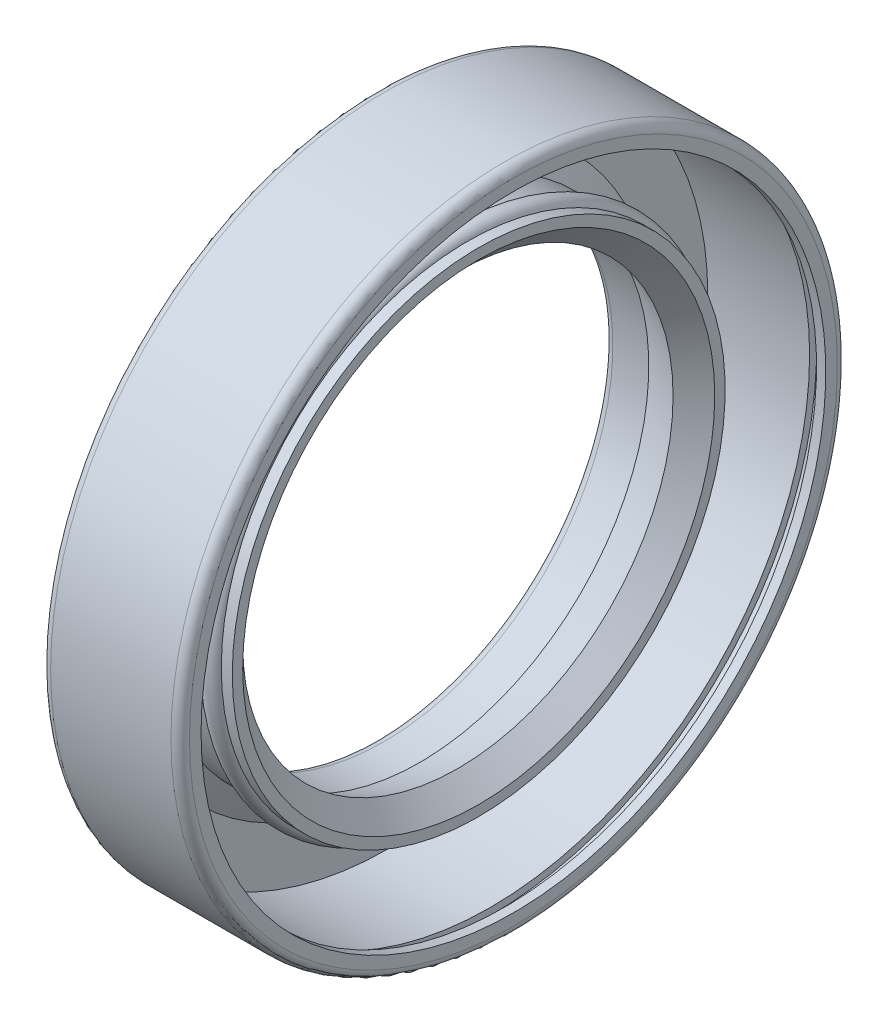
ISO-10303-21;
HEADER;
FILE_DESCRIPTION(('STEP AP214'),'2;1');
FILE_NAME('part.step','',(''),(''),'','','');
FILE_SCHEMA(('AUTOMOTIVE_DESIGN { 1 0 10303 214 1 1 1 1 }'));
ENDSEC;
DATA;
#1=APPLICATION_CONTEXT('core data for automotive mechanical design processes');
#2=APPLICATION_PROTOCOL_DEFINITION('international standard','automotive_design',2000,#1);
#3=PRODUCT_CONTEXT('',#1,'mechanical');
#4=PRODUCT('Part','Part','',(#3));
#5=PRODUCT_RELATED_PRODUCT_CATEGORY('part','',(#4));
#6=PRODUCT_DEFINITION_FORMATION('','',#4);
#7=PRODUCT_DEFINITION_CONTEXT('part definition',#1,'design');
#8=PRODUCT_DEFINITION('design','',#6,#7);
#9=PRODUCT_DEFINITION_SHAPE('','',#8);
#10=(LENGTH_UNIT() NAMED_UNIT(*) SI_UNIT(.MILLI.,.METRE.));
#11=(NAMED_UNIT(*) PLANE_ANGLE_UNIT() SI_UNIT($,.RADIAN.));
#12=(NAMED_UNIT(*) SI_UNIT($,.STERADIAN.) SOLID_ANGLE_UNIT());
#13=UNCERTAINTY_MEASURE_WITH_UNIT(LENGTH_MEASURE(1.E-05),#10,'distance_accuracy_value','');
#14=(GEOMETRIC_REPRESENTATION_CONTEXT(3) GLOBAL_UNCERTAINTY_ASSIGNED_CONTEXT((#13)) GLOBAL_UNIT_ASSIGNED_CONTEXT((#10,
#11,#12)) REPRESENTATION_CONTEXT('',''));
#15=CARTESIAN_POINT('',(0.,0.,0.));
#16=DIRECTION('',(0.,0.,1.));
#17=DIRECTION('',(1.,0.,0.));
#18=AXIS2_PLACEMENT_3D('',#15,#16,#17);
#19=CARTESIAN_POINT('',(0.,0.,0.));
#20=DIRECTION('',(-1.,0.,0.));
#21=DIRECTION('',(0.,0.,1.));
#22=AXIS2_PLACEMENT_3D('',#19,#20,#21);
#23=CONICAL_SURFACE('',#22,9.43301270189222,1.04719755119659);
#24=CARTESIAN_POINT('',(0.250000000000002,0.,0.));
#25=DIRECTION('',(-1.,0.,0.));
#26=DIRECTION('',(0.,0.,1.));
#27=AXIS2_PLACEMENT_3D('',#24,#25,#26);
#28=CIRCLE('',#27,9.);
#29=CARTESIAN_POINT('',(0.250000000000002,0.,9.));
#30=VERTEX_POINT('',#29);
#31=EDGE_CURVE('E10',#30,#30,#28,.T.);
#32=ORIENTED_EDGE('',*,*,#31,.F.);
#33=EDGE_LOOP('',(#32));
#34=FACE_BOUND('',#33,.T.);
#35=CARTESIAN_POINT('',(0.,0.,0.));
#36=DIRECTION('',(-1.,0.,0.));
#37=DIRECTION('',(0.,0.,1.));
#38=AXIS2_PLACEMENT_3D('',#35,#36,#37);
#39=CIRCLE('',#38,9.43301270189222);
#40=CARTESIAN_POINT('',(0.,0.,9.43301270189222));
#41=VERTEX_POINT('',#40);
#42=EDGE_CURVE('E97',#41,#41,#39,.T.);
#43=ORIENTED_EDGE('',*,*,#42,.T.);
#44=EDGE_LOOP('',(#43));
#45=FACE_BOUND('',#44,.T.);
#46=ADVANCED_FACE('F24',(#34,#45),#23,.F.);
#47=CARTESIAN_POINT('',(0.,0.,0.));
#48=DIRECTION('',(-1.,0.,0.));
#49=DIRECTION('',(0.,0.,1.));
#50=AXIS2_PLACEMENT_3D('',#47,#48,#49);
#51=CYLINDRICAL_SURFACE('',#50,9.);
#52=CARTESIAN_POINT('',(0.,0.,0.));
#53=DIRECTION('',(-1.,0.,0.));
#54=DIRECTION('',(0.,0.,1.));
#55=AXIS2_PLACEMENT_3D('',#52,#53,#54);
#56=CIRCLE('',#55,9.);
#57=CARTESIAN_POINT('',(0.,0.,9.));
#58=VERTEX_POINT('',#57);
#59=EDGE_CURVE('E30',#58,#58,#56,.T.);
#60=ORIENTED_EDGE('',*,*,#59,.F.);
#61=EDGE_LOOP('',(#60));
#62=FACE_BOUND('',#61,.T.);
#63=ORIENTED_EDGE('',*,*,#31,.T.);
#64=EDGE_LOOP('',(#63));
#65=FACE_BOUND('',#64,.T.);
#66=ADVANCED_FACE('F224',(#62,#65),#51,.T.);
#67=CARTESIAN_POINT('',(0.,0.,-9.));
#68=DIRECTION('',(1.,0.,0.));
#69=DIRECTION('',(0.,0.,-1.));
#70=AXIS2_PLACEMENT_3D('',#67,#68,#69);
#71=PLANE('',#70);
#72=CARTESIAN_POINT('',(0.,0.,0.));
#73=DIRECTION('',(-1.,0.,0.));
#74=DIRECTION('',(0.,0.,1.));
#75=AXIS2_PLACEMENT_3D('',#72,#73,#74);
#76=CIRCLE('',#75,8.58333333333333);
#77=CARTESIAN_POINT('',(0.,0.,8.58333333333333));
#78=VERTEX_POINT('',#77);
#79=EDGE_CURVE('E34',#78,#78,#76,.T.);
#80=ORIENTED_EDGE('',*,*,#79,.F.);
#81=EDGE_LOOP('',(#80));
#82=FACE_BOUND('',#81,.T.);
#83=ORIENTED_EDGE('',*,*,#59,.T.);
#84=EDGE_LOOP('',(#83));
#85=FACE_BOUND('',#84,.T.);
#86=ADVANCED_FACE('F219',(#82,#85),#71,.F.);
#87=CARTESIAN_POINT('',(0.333333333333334,0.,0.));
#88=DIRECTION('',(-1.,0.,0.));
#89=DIRECTION('',(0.,0.,1.));
#90=AXIS2_PLACEMENT_3D('',#87,#88,#89);
#91=TOROIDAL_SURFACE('',#90,8.58333333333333,0.333333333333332);
#92=CARTESIAN_POINT('',(0.333333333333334,0.,0.));
#93=DIRECTION('',(-1.,0.,0.));
#94=DIRECTION('',(0.,0.,1.));
#95=AXIS2_PLACEMENT_3D('',#92,#93,#94);
#96=CIRCLE('',#95,8.25);
#97=CARTESIAN_POINT('',(0.333333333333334,0.,8.25));
#98=VERTEX_POINT('',#97);
#99=EDGE_CURVE('E38',#98,#98,#96,.T.);
#100=ORIENTED_EDGE('',*,*,#99,.F.);
#101=EDGE_LOOP('',(#100));
#102=FACE_BOUND('',#101,.T.);
#103=ORIENTED_EDGE('',*,*,#79,.T.);
#104=EDGE_LOOP('',(#103));
#105=FACE_BOUND('',#104,.T.);
#106=ADVANCED_FACE('F213',(#102,#105),#91,.T.);
#107=CARTESIAN_POINT('',(0.,0.,0.));
#108=DIRECTION('',(-1.,0.,0.));
#109=DIRECTION('',(0.,0.,1.));
#110=AXIS2_PLACEMENT_3D('',#107,#108,#109);
#111=CYLINDRICAL_SURFACE('',#110,8.25);
#112=CARTESIAN_POINT('',(1.62626129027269,0.,0.));
#113=DIRECTION('',(-1.,0.,0.));
#114=DIRECTION('',(0.,0.,1.));
#115=AXIS2_PLACEMENT_3D('',#112,#113,#114);
#116=CIRCLE('',#115,8.25);
#117=CARTESIAN_POINT('',(1.62626129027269,0.,8.25));
#118=VERTEX_POINT('',#117);
#119=EDGE_CURVE('E43',#118,#118,#116,.T.);
#120=ORIENTED_EDGE('',*,*,#119,.F.);
#121=EDGE_LOOP('',(#120));
#122=FACE_BOUND('',#121,.T.);
#123=ORIENTED_EDGE('',*,*,#99,.T.);
#124=EDGE_LOOP('',(#123));
#125=FACE_BOUND('',#124,.T.);
#126=ADVANCED_FACE('F207',(#122,#125),#111,.F.);
#127=CARTESIAN_POINT('',(1.62626129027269,0.,0.));
#128=DIRECTION('',(-1.,0.,0.));
#129=DIRECTION('',(0.,0.,1.));
#130=AXIS2_PLACEMENT_3D('',#127,#128,#129);
#131=CONICAL_SURFACE('',#130,8.25,0.349065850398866);
#132=CARTESIAN_POINT('',(3.,0.,0.));
#133=DIRECTION('',(-1.,0.,0.));
#134=DIRECTION('',(0.,0.,1.));
#135=AXIS2_PLACEMENT_3D('',#132,#133,#134);
#136=CIRCLE('',#135,7.75);
#137=CARTESIAN_POINT('',(3.,0.,7.75));
#138=VERTEX_POINT('',#137);
#139=EDGE_CURVE('E46',#138,#138,#136,.T.);
#140=ORIENTED_EDGE('',*,*,#139,.F.);
#141=EDGE_LOOP('',(#140));
#142=FACE_BOUND('',#141,.T.);
#143=ORIENTED_EDGE('',*,*,#119,.T.);
#144=EDGE_LOOP('',(#143));
#145=FACE_BOUND('',#144,.T.);
#146=ADVANCED_FACE('F201',(#142,#145),#131,.F.);
#147=CARTESIAN_POINT('',(3.,0.,0.));
#148=DIRECTION('',(1.,0.,0.));
#149=DIRECTION('',(0.,0.,-1.));
#150=AXIS2_PLACEMENT_3D('',#147,#148,#149);
#151=CONICAL_SURFACE('',#150,7.75,0.78539816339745);
#152=CARTESIAN_POINT('',(3.75,0.,0.));
#153=DIRECTION('',(-1.,0.,0.));
#154=DIRECTION('',(0.,0.,1.));
#155=AXIS2_PLACEMENT_3D('',#152,#153,#154);
#156=CIRCLE('',#155,8.5);
#157=CARTESIAN_POINT('',(3.75,0.,8.5));
#158=VERTEX_POINT('',#157);
#159=EDGE_CURVE('E49',#158,#158,#156,.T.);
#160=ORIENTED_EDGE('',*,*,#159,.F.);
#161=EDGE_LOOP('',(#160));
#162=FACE_BOUND('',#161,.T.);
#163=ORIENTED_EDGE('',*,*,#139,.T.);
#164=EDGE_LOOP('',(#163));
#165=FACE_BOUND('',#164,.T.);
#166=ADVANCED_FACE('F195',(#162,#165),#151,.F.);
#167=CARTESIAN_POINT('',(3.75,0.,-8.5));
#168=DIRECTION('',(-1.,0.,0.));
#169=DIRECTION('',(0.,0.,1.));
#170=AXIS2_PLACEMENT_3D('',#167,#168,#169);
#171=PLANE('',#170);
#172=CARTESIAN_POINT('',(3.75,0.,0.));
#173=DIRECTION('',(-1.,0.,0.));
#174=DIRECTION('',(0.,0.,1.));
#175=AXIS2_PLACEMENT_3D('',#172,#173,#174);
#176=CIRCLE('',#175,8.875);
#177=CARTESIAN_POINT('',(3.75,0.,8.875));
#178=VERTEX_POINT('',#177);
#179=EDGE_CURVE('E52',#178,#178,#176,.T.);
#180=ORIENTED_EDGE('',*,*,#179,.F.);
#181=EDGE_LOOP('',(#180));
#182=FACE_BOUND('',#181,.T.);
#183=ORIENTED_EDGE('',*,*,#159,.T.);
#184=EDGE_LOOP('',(#183));
#185=FACE_BOUND('',#184,.T.);
#186=ADVANCED_FACE('F189',(#182,#185),#171,.F.);
#187=CARTESIAN_POINT('',(0.,0.,0.));
#188=DIRECTION('',(-1.,0.,0.));
#189=DIRECTION('',(0.,0.,1.));
#190=AXIS2_PLACEMENT_3D('',#187,#188,#189);
#191=CYLINDRICAL_SURFACE('',#190,8.875);
#192=CARTESIAN_POINT('',(3.35355339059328,0.,0.));
#193=DIRECTION('',(-1.,0.,0.));
#194=DIRECTION('',(0.,0.,1.));
#195=AXIS2_PLACEMENT_3D('',#192,#193,#194);
#196=CIRCLE('',#195,8.875);
#197=CARTESIAN_POINT('',(3.35355339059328,0.,8.875));
#198=VERTEX_POINT('',#197);
#199=EDGE_CURVE('E55',#198,#198,#196,.T.);
#200=ORIENTED_EDGE('',*,*,#199,.F.);
#201=EDGE_LOOP('',(#200));
#202=FACE_BOUND('',#201,.T.);
#203=ORIENTED_EDGE('',*,*,#179,.T.);
#204=EDGE_LOOP('',(#203));
#205=FACE_BOUND('',#204,.T.);
#206=ADVANCED_FACE('F183',(#202,#205),#191,.T.);
#207=CARTESIAN_POINT('',(3.,0.,0.));
#208=DIRECTION('',(-1.,0.,0.));
#209=DIRECTION('',(0.,0.,1.));
#210=AXIS2_PLACEMENT_3D('',#207,#208,#209);
#211=TOROIDAL_SURFACE('',#210,8.75,0.375);
#212=CARTESIAN_POINT('',(2.625,0.,0.));
#213=DIRECTION('',(-1.,0.,0.));
#214=DIRECTION('',(0.,0.,1.));
#215=AXIS2_PLACEMENT_3D('',#212,#213,#214);
#216=CIRCLE('',#215,8.75);
#217=CARTESIAN_POINT('',(2.625,0.,8.75));
#218=VERTEX_POINT('',#217);
#219=EDGE_CURVE('E58',#218,#218,#216,.T.);
#220=ORIENTED_EDGE('',*,*,#219,.F.);
#221=EDGE_LOOP('',(#220));
#222=FACE_BOUND('',#221,.T.);
#223=ORIENTED_EDGE('',*,*,#199,.T.);
#224=EDGE_LOOP('',(#223));
#225=FACE_BOUND('',#224,.T.);
#226=ADVANCED_FACE('F177',(#222,#225),#211,.T.);
#227=CARTESIAN_POINT('',(0.,0.,0.));
#228=DIRECTION('',(-1.,0.,0.));
#229=DIRECTION('',(0.,0.,1.));
#230=AXIS2_PLACEMENT_3D('',#227,#228,#229);
#231=CYLINDRICAL_SURFACE('',#230,8.75);
#232=CARTESIAN_POINT('',(0.971687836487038,0.,0.));
#233=DIRECTION('',(-1.,0.,0.));
#234=DIRECTION('',(0.,0.,1.));
#235=AXIS2_PLACEMENT_3D('',#232,#233,#234);
#236=CIRCLE('',#235,8.75);
#237=CARTESIAN_POINT('',(0.971687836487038,0.,8.75));
#238=VERTEX_POINT('',#237);
#239=EDGE_CURVE('E61',#238,#238,#236,.T.);
#240=ORIENTED_EDGE('',*,*,#239,.F.);
#241=EDGE_LOOP('',(#240));
#242=FACE_BOUND('',#241,.T.);
#243=ORIENTED_EDGE('',*,*,#219,.T.);
#244=EDGE_LOOP('',(#243));
#245=FACE_BOUND('',#244,.T.);
#246=ADVANCED_FACE('F171',(#242,#245),#231,.T.);
#247=CARTESIAN_POINT('',(0.971687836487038,0.,0.));
#248=DIRECTION('',(-1.,0.,0.));
#249=DIRECTION('',(0.,0.,1.));
#250=AXIS2_PLACEMENT_3D('',#247,#248,#249);
#251=CONICAL_SURFACE('',#250,8.75,1.04719755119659);
#252=CARTESIAN_POINT('',(0.500000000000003,0.,0.));
#253=DIRECTION('',(-1.,0.,0.));
#254=DIRECTION('',(0.,0.,1.));
#255=AXIS2_PLACEMENT_3D('',#252,#253,#254);
#256=CIRCLE('',#255,9.56698729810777);
#257=CARTESIAN_POINT('',(0.500000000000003,0.,9.56698729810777));
#258=VERTEX_POINT('',#257);
#259=EDGE_CURVE('E64',#258,#258,#256,.T.);
#260=ORIENTED_EDGE('',*,*,#259,.F.);
#261=EDGE_LOOP('',(#260));
#262=FACE_BOUND('',#261,.T.);
#263=ORIENTED_EDGE('',*,*,#239,.T.);
#264=EDGE_LOOP('',(#263));
#265=FACE_BOUND('',#264,.T.);
#266=ADVANCED_FACE('F165',(#262,#265),#251,.T.);
#267=CARTESIAN_POINT('',(0.500000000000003,0.,-11.5));
#268=DIRECTION('',(-1.,0.,0.));
#269=DIRECTION('',(0.,0.,1.));
#270=AXIS2_PLACEMENT_3D('',#267,#268,#269);
#271=PLANE('',#270);
#272=CARTESIAN_POINT('',(0.500000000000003,0.,0.));
#273=DIRECTION('',(-1.,0.,0.));
#274=DIRECTION('',(0.,0.,1.));
#275=AXIS2_PLACEMENT_3D('',#272,#273,#274);
#276=CIRCLE('',#275,11.5);
#277=CARTESIAN_POINT('',(0.500000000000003,0.,11.5));
#278=VERTEX_POINT('',#277);
#279=EDGE_CURVE('E67',#278,#278,#276,.T.);
#280=ORIENTED_EDGE('',*,*,#279,.F.);
#281=EDGE_LOOP('',(#280));
#282=FACE_BOUND('',#281,.T.);
#283=ORIENTED_EDGE('',*,*,#259,.T.);
#284=EDGE_LOOP('',(#283));
#285=FACE_BOUND('',#284,.T.);
#286=ADVANCED_FACE('F159',(#282,#285),#271,.F.);
#287=CARTESIAN_POINT('',(0.,0.,0.));
#288=DIRECTION('',(-1.,0.,0.));
#289=DIRECTION('',(0.,0.,1.));
#290=AXIS2_PLACEMENT_3D('',#287,#288,#289);
#291=CYLINDRICAL_SURFACE('',#290,11.5);
#292=CARTESIAN_POINT('',(4.16666666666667,0.,0.));
#293=DIRECTION('',(-1.,0.,0.));
#294=DIRECTION('',(0.,0.,1.));
#295=AXIS2_PLACEMENT_3D('',#292,#293,#294);
#296=CIRCLE('',#295,11.5);
#297=CARTESIAN_POINT('',(4.16666666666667,0.,11.5));
#298=VERTEX_POINT('',#297);
#299=EDGE_CURVE('E70',#298,#298,#296,.T.);
#300=ORIENTED_EDGE('',*,*,#299,.F.);
#301=EDGE_LOOP('',(#300));
#302=FACE_BOUND('',#301,.T.);
#303=ORIENTED_EDGE('',*,*,#279,.T.);
#304=EDGE_LOOP('',(#303));
#305=FACE_BOUND('',#304,.T.);
#306=ADVANCED_FACE('F153',(#302,#305),#291,.F.);
#307=CARTESIAN_POINT('',(4.16666666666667,0.,-11.5));
#308=DIRECTION('',(-1.,0.,0.));
#309=DIRECTION('',(0.,0.,1.));
#310=AXIS2_PLACEMENT_3D('',#307,#308,#309);
#311=PLANE('',#310);
#312=CARTESIAN_POINT('',(4.16666666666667,0.,0.));
#313=DIRECTION('',(-1.,0.,0.));
#314=DIRECTION('',(0.,0.,1.));
#315=AXIS2_PLACEMENT_3D('',#312,#313,#314);
#316=CIRCLE('',#315,11.75);
#317=CARTESIAN_POINT('',(4.16666666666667,0.,11.75));
#318=VERTEX_POINT('',#317);
#319=EDGE_CURVE('E73',#318,#318,#316,.T.);
#320=ORIENTED_EDGE('',*,*,#319,.F.);
#321=EDGE_LOOP('',(#320));
#322=FACE_BOUND('',#321,.T.);
#323=ORIENTED_EDGE('',*,*,#299,.T.);
#324=EDGE_LOOP('',(#323));
#325=FACE_BOUND('',#324,.T.);
#326=ADVANCED_FACE('F147',(#322,#325),#311,.F.);
#327=CARTESIAN_POINT('',(0.,0.,0.));
#328=DIRECTION('',(-1.,0.,0.));
#329=DIRECTION('',(0.,0.,1.));
#330=AXIS2_PLACEMENT_3D('',#327,#328,#329);
#331=CYLINDRICAL_SURFACE('',#330,11.75);
#332=CARTESIAN_POINT('',(4.66666666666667,0.,0.));
#333=DIRECTION('',(-1.,0.,0.));
#334=DIRECTION('',(0.,0.,1.));
#335=AXIS2_PLACEMENT_3D('',#332,#333,#334);
#336=CIRCLE('',#335,11.75);
#337=CARTESIAN_POINT('',(4.66666666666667,0.,11.75));
#338=VERTEX_POINT('',#337);
#339=EDGE_CURVE('E76',#338,#338,#336,.T.);
#340=ORIENTED_EDGE('',*,*,#339,.F.);
#341=EDGE_LOOP('',(#340));
#342=FACE_BOUND('',#341,.T.);
#343=ORIENTED_EDGE('',*,*,#319,.T.);
#344=EDGE_LOOP('',(#343));
#345=FACE_BOUND('',#344,.T.);
#346=ADVANCED_FACE('F141',(#342,#345),#331,.F.);
#347=CARTESIAN_POINT('',(4.66666666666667,0.,-11.75));
#348=DIRECTION('',(1.,0.,0.));
#349=DIRECTION('',(0.,0.,-1.));
#350=AXIS2_PLACEMENT_3D('',#347,#348,#349);
#351=PLANE('',#350);
#352=CARTESIAN_POINT('',(4.66666666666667,0.,0.));
#353=DIRECTION('',(-1.,0.,0.));
#354=DIRECTION('',(0.,0.,1.));
#355=AXIS2_PLACEMENT_3D('',#352,#353,#354);
#356=CIRCLE('',#355,11.25);
#357=CARTESIAN_POINT('',(4.66666666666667,0.,11.25));
#358=VERTEX_POINT('',#357);
#359=EDGE_CURVE('E79',#358,#358,#356,.T.);
#360=ORIENTED_EDGE('',*,*,#359,.F.);
#361=EDGE_LOOP('',(#360));
#362=FACE_BOUND('',#361,.T.);
#363=ORIENTED_EDGE('',*,*,#339,.T.);
#364=EDGE_LOOP('',(#363));
#365=FACE_BOUND('',#364,.T.);
#366=ADVANCED_FACE('F135',(#362,#365),#351,.F.);
#367=CARTESIAN_POINT('',(0.,0.,0.));
#368=DIRECTION('',(-1.,0.,0.));
#369=DIRECTION('',(0.,0.,1.));
#370=AXIS2_PLACEMENT_3D('',#367,#368,#369);
#371=CYLINDRICAL_SURFACE('',#370,11.25);
#372=CARTESIAN_POINT('',(5.,0.,0.));
#373=DIRECTION('',(-1.,0.,0.));
#374=DIRECTION('',(0.,0.,1.));
#375=AXIS2_PLACEMENT_3D('',#372,#373,#374);
#376=CIRCLE('',#375,11.25);
#377=CARTESIAN_POINT('',(5.,0.,11.25));
#378=VERTEX_POINT('',#377);
#379=EDGE_CURVE('E82',#378,#378,#376,.T.);
#380=ORIENTED_EDGE('',*,*,#379,.F.);
#381=EDGE_LOOP('',(#380));
#382=FACE_BOUND('',#381,.T.);
#383=ORIENTED_EDGE('',*,*,#359,.T.);
#384=EDGE_LOOP('',(#383));
#385=FACE_BOUND('',#384,.T.);
#386=ADVANCED_FACE('F129',(#382,#385),#371,.F.);
#387=CARTESIAN_POINT('',(5.,0.,-11.25));
#388=DIRECTION('',(-1.,0.,0.));
#389=DIRECTION('',(0.,0.,1.));
#390=AXIS2_PLACEMENT_3D('',#387,#388,#389);
#391=PLANE('',#390);
#392=CARTESIAN_POINT('',(5.,0.,0.));
#393=DIRECTION('',(-1.,0.,0.));
#394=DIRECTION('',(0.,0.,1.));
#395=AXIS2_PLACEMENT_3D('',#392,#393,#394);
#396=CIRCLE('',#395,11.6666666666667);
#397=CARTESIAN_POINT('',(5.,0.,11.6666666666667));
#398=VERTEX_POINT('',#397);
#399=EDGE_CURVE('E85',#398,#398,#396,.T.);
#400=ORIENTED_EDGE('',*,*,#399,.F.);
#401=EDGE_LOOP('',(#400));
#402=FACE_BOUND('',#401,.T.);
#403=ORIENTED_EDGE('',*,*,#379,.T.);
#404=EDGE_LOOP('',(#403));
#405=FACE_BOUND('',#404,.T.);
#406=ADVANCED_FACE('F123',(#402,#405),#391,.F.);
#407=CARTESIAN_POINT('',(4.66666666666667,0.,0.));
#408=DIRECTION('',(-1.,0.,0.));
#409=DIRECTION('',(0.,0.,1.));
#410=AXIS2_PLACEMENT_3D('',#407,#408,#409);
#411=TOROIDAL_SURFACE('',#410,11.6666666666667,0.333333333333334);
#412=CARTESIAN_POINT('',(4.66666666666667,0.,0.));
#413=DIRECTION('',(-1.,0.,0.));
#414=DIRECTION('',(0.,0.,1.));
#415=AXIS2_PLACEMENT_3D('',#412,#413,#414);
#416=CIRCLE('',#415,12.);
#417=CARTESIAN_POINT('',(4.66666666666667,0.,12.));
#418=VERTEX_POINT('',#417);
#419=EDGE_CURVE('E88',#418,#418,#416,.T.);
#420=ORIENTED_EDGE('',*,*,#419,.F.);
#421=EDGE_LOOP('',(#420));
#422=FACE_BOUND('',#421,.T.);
#423=ORIENTED_EDGE('',*,*,#399,.T.);
#424=EDGE_LOOP('',(#423));
#425=FACE_BOUND('',#424,.T.);
#426=ADVANCED_FACE('F117',(#422,#425),#411,.T.);
#427=CARTESIAN_POINT('',(0.,0.,0.));
#428=DIRECTION('',(-1.,0.,0.));
#429=DIRECTION('',(0.,0.,1.));
#430=AXIS2_PLACEMENT_3D('',#427,#428,#429);
#431=CYLINDRICAL_SURFACE('',#430,12.);
#432=CARTESIAN_POINT('',(0.333333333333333,0.,0.));
#433=DIRECTION('',(-1.,0.,0.));
#434=DIRECTION('',(0.,0.,1.));
#435=AXIS2_PLACEMENT_3D('',#432,#433,#434);
#436=CIRCLE('',#435,12.);
#437=CARTESIAN_POINT('',(0.333333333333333,0.,12.));
#438=VERTEX_POINT('',#437);
#439=EDGE_CURVE('E91',#438,#438,#436,.T.);
#440=ORIENTED_EDGE('',*,*,#439,.F.);
#441=EDGE_LOOP('',(#440));
#442=FACE_BOUND('',#441,.T.);
#443=ORIENTED_EDGE('',*,*,#419,.T.);
#444=EDGE_LOOP('',(#443));
#445=FACE_BOUND('',#444,.T.);
#446=ADVANCED_FACE('F111',(#442,#445),#431,.T.);
#447=CARTESIAN_POINT('',(0.333333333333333,0.,0.));
#448=DIRECTION('',(-1.,0.,0.));
#449=DIRECTION('',(0.,0.,1.));
#450=AXIS2_PLACEMENT_3D('',#447,#448,#449);
#451=TOROIDAL_SURFACE('',#450,11.6666666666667,0.333333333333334);
#452=CARTESIAN_POINT('',(0.,0.,0.));
#453=DIRECTION('',(-1.,0.,0.));
#454=DIRECTION('',(0.,0.,1.));
#455=AXIS2_PLACEMENT_3D('',#452,#453,#454);
#456=CIRCLE('',#455,11.6666666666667);
#457=CARTESIAN_POINT('',(0.,0.,11.6666666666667));
#458=VERTEX_POINT('',#457);
#459=EDGE_CURVE('E94',#458,#458,#456,.T.);
#460=ORIENTED_EDGE('',*,*,#459,.F.);
#461=EDGE_LOOP('',(#460));
#462=FACE_BOUND('',#461,.T.);
#463=ORIENTED_EDGE('',*,*,#439,.T.);
#464=EDGE_LOOP('',(#463));
#465=FACE_BOUND('',#464,.T.);
#466=ADVANCED_FACE('F105',(#462,#465),#451,.T.);
#467=CARTESIAN_POINT('',(0.,0.,-9.43301270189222));
#468=DIRECTION('',(1.,0.,0.));
#469=DIRECTION('',(0.,0.,-1.));
#470=AXIS2_PLACEMENT_3D('',#467,#468,#469);
#471=PLANE('',#470);
#472=ORIENTED_EDGE('',*,*,#42,.F.);
#473=EDGE_LOOP('',(#472));
#474=FACE_BOUND('',#473,.T.);
#475=ORIENTED_EDGE('',*,*,#459,.T.);
#476=EDGE_LOOP('',(#475));
#477=FACE_BOUND('',#476,.T.);
#478=ADVANCED_FACE('F102',(#474,#477),#471,.F.);
#479=CLOSED_SHELL('',(#46,#66,#86,#106,#126,#146,#166,#186,#206,#226,#246,#266,#286,#306,#326,
#346,#366,#386,#406,#426,#446,#466,#478));
#480=MANIFOLD_SOLID_BREP('B2',#479);
#481=ADVANCED_BREP_SHAPE_REPRESENTATION('',(#18,#480),#14);
#482=SHAPE_DEFINITION_REPRESENTATION(#9,#481);
ENDSEC;
END-ISO-10303-21;
